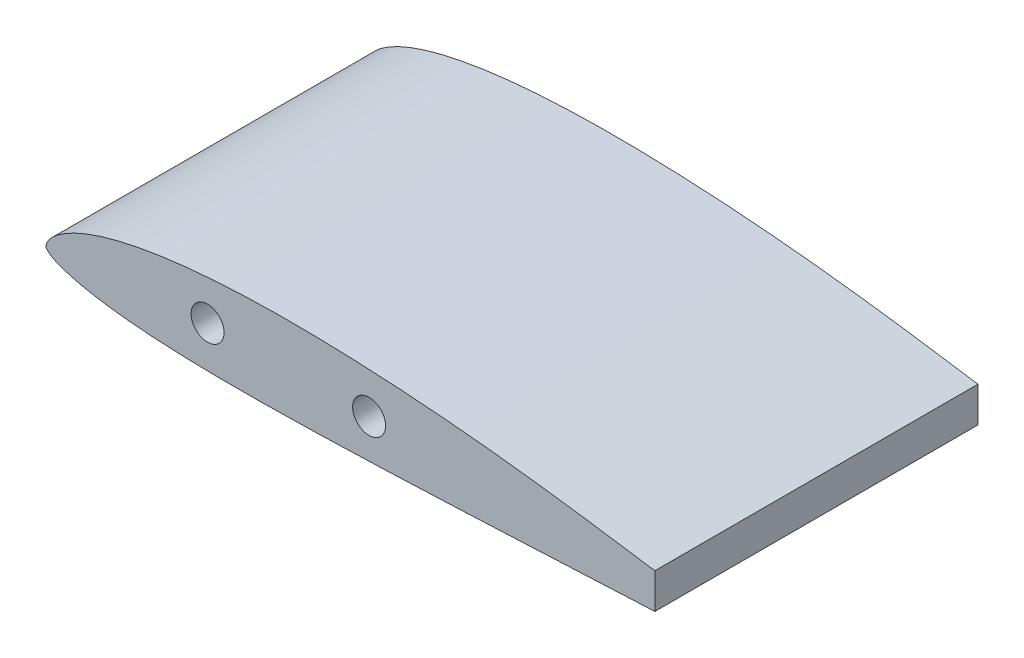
from build123d import *

# Parameters (mm, degrees)
SALIENTE_EXTRUIR1_DEPTH      = 50
SALIENTE_EXTRUIR1_DEPTH_BACK = 50
CROQUIS3_R                   = 5.1
CORTAR_EXTRUIR1_DEPTH        = 30


with BuildPart() as part:
    # Croquis2 → Saliente-Extruir1 (new, two sides: drawn at the far end of the back side and taken through both)
    with BuildSketch(Plane.XY.offset(-SALIENTE_EXTRUIR1_DEPTH_BACK)):
        with BuildLine():
            Line((188.450009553, 7.339214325), (188.450009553, -3.579701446))
            add(Edge.make_bspline(
                [(188.450009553, 7.339214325), (186.971120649, 7.560458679), (181.340460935, 8.403840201), (171.477012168, 9.87348203), (158.801394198, 11.6487292), (145.970739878, 13.267855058), (133.084342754, 14.671007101), (120.243383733, 15.821528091), (107.557769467, 16.71400186), (95.144877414, 17.338563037), (83.125493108, 17.680673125), (71.614418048, 17.730880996), (60.715109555, 17.465148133), (50.518623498, 16.881608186), (41.1045317, 15.986029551), (32.544782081, 14.796639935), (24.902968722, 13.339290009), (18.230866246, 11.647893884), (12.567751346, 9.74446836), (7.937880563, 7.685197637), (4.345128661, 5.549209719), (1.873742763, 3.502082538), (0.600881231, 1.905762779), (0.15681466, 0.905046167), (0.027739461, 0.443615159), (-0.01269825, 0.076397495), (0.018759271, -0.214234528), (0.157842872, -0.479662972), (0.411209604, -0.787972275), (0.809035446, -1.148833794), (1.242647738, -1.461072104), (2.42793524, -2.221519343), (4.879064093, -3.263328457), (9.078588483, -4.517961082), (14.504480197, -5.662897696), (21.090153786, -6.657087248), (28.794886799, -7.446053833), (37.563313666, -8.008009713), (47.335553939, -8.343427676), (58.033866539, -8.459401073), (69.562333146, -8.389446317), (86.254127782, -8.06688589), (108.231076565, -7.306648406), (130.695416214, -6.315383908), (148.948878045, -5.465843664), (162.467008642, -4.822212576), (175.612989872, -4.194800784), (184.2342693, -3.781297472), (188.450009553, -3.579701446)],
                knots=[0.133852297, 0.133852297, 0.133852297, 0.133852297, 0.142437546, 0.16654026, 0.191106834, 0.215921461, 0.240786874, 0.265525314, 0.289936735, 0.31379499, 0.336877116, 0.358966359, 0.379877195, 0.399462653, 0.417591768, 0.434156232, 0.449061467, 0.462234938, 0.473645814, 0.483320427, 0.491279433, 0.497559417, 0.501679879, 0.502824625, 0.503826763, 0.504416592, 0.504939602, 0.505476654, 0.506108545, 0.507226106, 0.50854806, 0.509172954, 0.515309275, 0.523717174, 0.534339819, 0.547106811, 0.561945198, 0.578791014, 0.597544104, 0.618077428, 0.640213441, 0.663731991, 0.713926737, 0.766462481, 0.792832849, 0.818839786, 0.844162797, 0.868394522, 0.868394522, 0.868394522, 0.868394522], degree=3))
        make_face()
    extrude(amount=SALIENTE_EXTRUIR1_DEPTH + SALIENTE_EXTRUIR1_DEPTH_BACK)

    # Croquis3 → Cortar-Extruir1 (cut)
    with BuildSketch(Plane.XY.offset(50)):
        with Locations((50, 4.47)):
            Circle(CROQUIS3_R)
        with Locations((100, 4.47)):
            Circle(CROQUIS3_R)
    cortar_extruir1 = extrude(amount=-CORTAR_EXTRUIR1_DEPTH, mode=Mode.SUBTRACT)

    # Simetr_a1: Cortar-Extruir1 across plane
    add(cortar_extruir1.mirror(Plane.XY), mode=Mode.SUBTRACT)


solid = part.part
